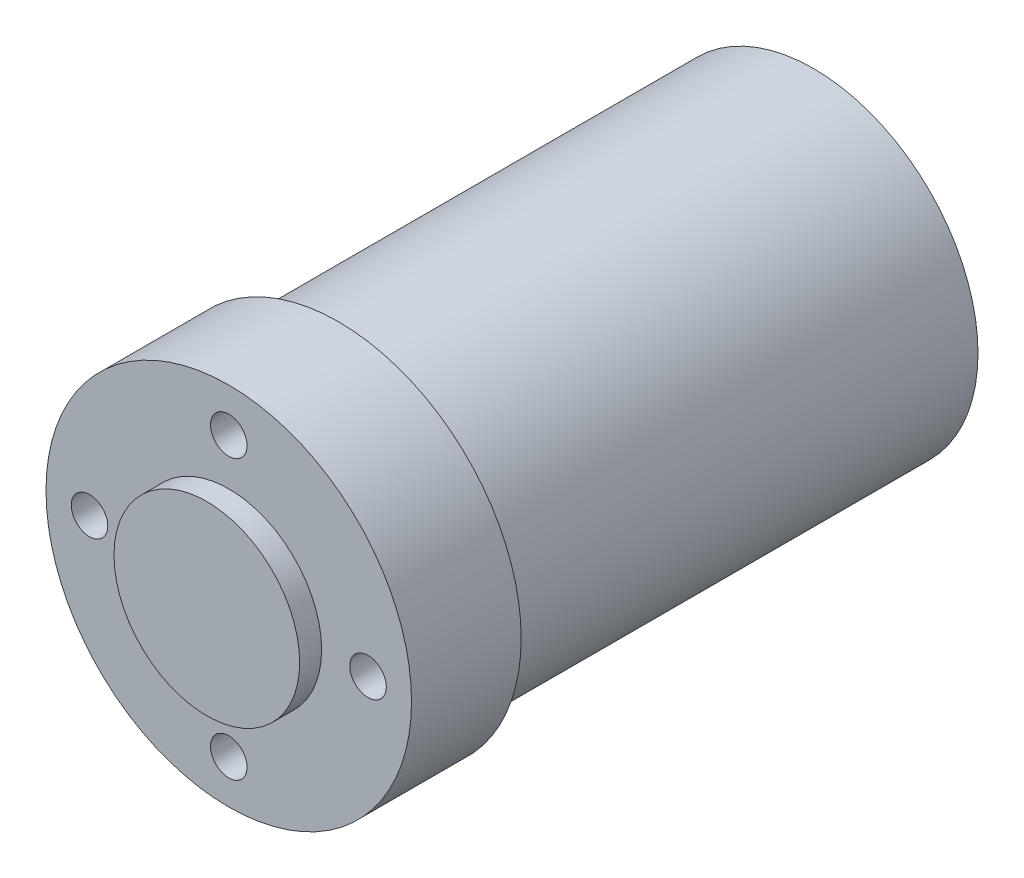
from build123d import *

# Parameters (mm, degrees)
SKETCH1_W                  = 25
SKETCH1_H                  = 15
SKETCH2_R                  = 12.7
BOSS_EXTRUDE1_DEPTH        = 3
SKETCH3_R                  = 22.4917
BOSS_EXTRUDE2_DEPTH        = 65
F_10_CLEARANCE_HOLE1_D     = 5
F_10_CLEARANCE_HOLE1_DEPTH = 8
F_10_CLEARANCE_HOLE2_D     = 5
F_10_CLEARANCE_HOLE2_DEPTH = 12.446


with BuildPart() as part:
    # Sketch1 → Revolve1 (revolve)
    with BuildSketch(Plane.XZ, mode=Mode.PRIVATE) as revolve1_sk:
        with Locations((12.5, 72.5)):
            Rectangle(SKETCH1_W, SKETCH1_H)
    revolve(revolve1_sk.sketch.rotate(Axis((0, 0, 80), (0, 0, -1)), 180), axis=Axis((0, 0, 80), (0, 0, -1)))

    # Sketch2 → Boss-Extrude1 (add)
    with BuildSketch(Plane.XY.offset(80)):
        Circle(SKETCH2_R)
    extrude(amount=BOSS_EXTRUDE1_DEPTH)

    # Sketch3 → Boss-Extrude2 (add)
    with BuildSketch(Plane(origin=(0, 0, 65), x_dir=(-1, 0, 0), z_dir=(0, 0, -1))):
        Circle(SKETCH3_R)
    extrude(amount=BOSS_EXTRUDE2_DEPTH)

    # 10 Clearance Hole1
    with Locations(Plane(origin=(0, 0, 0), x_dir=(-1, 0, 0), z_dir=(0, 0, -1))):
        with Locations((-12.374368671, 12.374368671), (-17.5, 0), (-12.374368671, -12.374368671), (0, -17.5), (12.374368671, -12.374368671), (17.5, 0), (12.374368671, 12.374368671), (0, 17.5)):
            Hole(F_10_CLEARANCE_HOLE1_D / 2, depth=F_10_CLEARANCE_HOLE1_DEPTH)

    # 10 Clearance Hole2
    with Locations(Plane.XY.offset(80)):
        with Locations((-19.05, 0), (0, -19.05), (19.05, 0), (0, 19.05)):
            Hole(F_10_CLEARANCE_HOLE2_D / 2, depth=F_10_CLEARANCE_HOLE2_DEPTH)


solid = part.part
